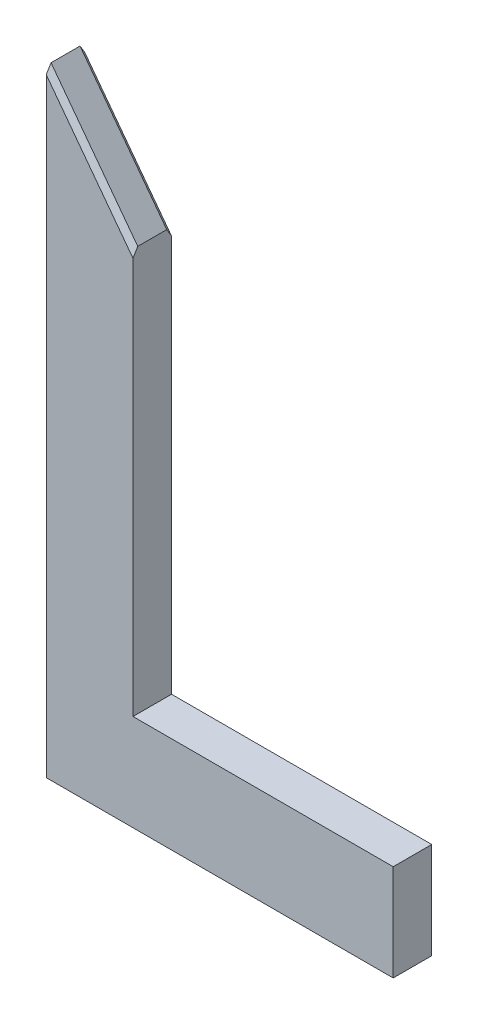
ISO-10303-21;
HEADER;
FILE_DESCRIPTION(('STEP AP214'),'2;1');
FILE_NAME('part.step','',(''),(''),'','','');
FILE_SCHEMA(('AUTOMOTIVE_DESIGN { 1 0 10303 214 1 1 1 1 }'));
ENDSEC;
DATA;
#1=APPLICATION_CONTEXT('core data for automotive mechanical design processes');
#2=APPLICATION_PROTOCOL_DEFINITION('international standard','automotive_design',2000,#1);
#3=PRODUCT_CONTEXT('',#1,'mechanical');
#4=PRODUCT('Part','Part','',(#3));
#5=PRODUCT_RELATED_PRODUCT_CATEGORY('part','',(#4));
#6=PRODUCT_DEFINITION_FORMATION('','',#4);
#7=PRODUCT_DEFINITION_CONTEXT('part definition',#1,'design');
#8=PRODUCT_DEFINITION('design','',#6,#7);
#9=PRODUCT_DEFINITION_SHAPE('','',#8);
#10=(LENGTH_UNIT() NAMED_UNIT(*) SI_UNIT(.MILLI.,.METRE.));
#11=(NAMED_UNIT(*) PLANE_ANGLE_UNIT() SI_UNIT($,.RADIAN.));
#12=(NAMED_UNIT(*) SI_UNIT($,.STERADIAN.) SOLID_ANGLE_UNIT());
#13=UNCERTAINTY_MEASURE_WITH_UNIT(LENGTH_MEASURE(1.E-05),#10,'distance_accuracy_value','');
#14=(GEOMETRIC_REPRESENTATION_CONTEXT(3) GLOBAL_UNCERTAINTY_ASSIGNED_CONTEXT((#13)) GLOBAL_UNIT_ASSIGNED_CONTEXT((#10,
#11,#12)) REPRESENTATION_CONTEXT('',''));
#15=CARTESIAN_POINT('',(0.,0.,0.));
#16=DIRECTION('',(0.,0.,1.));
#17=DIRECTION('',(1.,0.,0.));
#18=AXIS2_PLACEMENT_3D('',#15,#16,#17);
#19=CARTESIAN_POINT('',(0.,0.,-12.7));
#20=DIRECTION('',(-1.,0.,0.));
#21=DIRECTION('',(0.,0.,1.));
#22=AXIS2_PLACEMENT_3D('',#19,#20,#21);
#23=PLANE('',#22);
#24=DIRECTION('',(0.,-1.,0.));
#25=VECTOR('',#24,1.);
#26=CARTESIAN_POINT('',(0.,0.,0.));
#27=LINE('',#26,#25);
#28=CARTESIAN_POINT('',(0.,200.575333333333,0.));
#29=VERTEX_POINT('',#28);
#30=CARTESIAN_POINT('',(0.,0.,0.));
#31=VERTEX_POINT('',#30);
#32=EDGE_CURVE('E131',#29,#31,#27,.T.);
#33=ORIENTED_EDGE('',*,*,#32,.F.);
#34=DIRECTION('',(0.,0.857492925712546,-0.514495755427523));
#35=VECTOR('',#34,1.);
#36=CARTESIAN_POINT('',(0.,58.6964117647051,85.1273529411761));
#37=LINE('',#36,#35);
#38=CARTESIAN_POINT('',(0.,203.2,-1.57480000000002));
#39=VERTEX_POINT('',#38);
#40=EDGE_CURVE('E150',#29,#39,#37,.T.);
#41=ORIENTED_EDGE('',*,*,#40,.T.);
#42=DIRECTION('',(0.,0.,1.));
#43=VECTOR('',#42,1.);
#44=CARTESIAN_POINT('',(0.,203.2,-12.7));
#45=LINE('',#44,#43);
#46=CARTESIAN_POINT('',(0.,203.2,-11.1252));
#47=VERTEX_POINT('',#46);
#48=EDGE_CURVE('E141',#47,#39,#45,.T.);
#49=ORIENTED_EDGE('',*,*,#48,.F.);
#50=DIRECTION('',(0.,0.857492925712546,0.514495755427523));
#51=VECTOR('',#50,1.);
#52=CARTESIAN_POINT('',(0.,53.0934705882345,-101.189117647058));
#53=LINE('',#52,#51);
#54=CARTESIAN_POINT('',(0.,200.575333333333,-12.7));
#55=VERTEX_POINT('',#54);
#56=EDGE_CURVE('E148',#47,#55,#53,.F.);
#57=ORIENTED_EDGE('',*,*,#56,.T.);
#58=DIRECTION('',(0.,-1.,0.));
#59=VECTOR('',#58,1.);
#60=CARTESIAN_POINT('',(0.,0.,-12.7));
#61=LINE('',#60,#59);
#62=CARTESIAN_POINT('',(0.,0.,-12.7));
#63=VERTEX_POINT('',#62);
#64=EDGE_CURVE('E132',#55,#63,#61,.T.);
#65=ORIENTED_EDGE('',*,*,#64,.T.);
#66=DIRECTION('',(0.,0.,1.));
#67=VECTOR('',#66,1.);
#68=CARTESIAN_POINT('',(0.,0.,-12.7));
#69=LINE('',#68,#67);
#70=EDGE_CURVE('E137',#63,#31,#69,.T.);
#71=ORIENTED_EDGE('',*,*,#70,.T.);
#72=EDGE_LOOP('',(#33,#41,#49,#57,#65,#71));
#73=FACE_BOUND('',#72,.T.);
#74=ADVANCED_FACE('F34',(#73),#23,.T.);
#75=CARTESIAN_POINT('',(0.,203.2,-12.7));
#76=DIRECTION('',(0.8,0.6,0.));
#77=DIRECTION('',(-0.6,0.8,0.));
#78=AXIS2_PLACEMENT_3D('',#75,#76,#77);
#79=PLANE('',#78);
#80=DIRECTION('',(0.,0.,1.));
#81=VECTOR('',#80,1.);
#82=CARTESIAN_POINT('',(28.575,165.1,-12.7));
#83=LINE('',#82,#81);
#84=CARTESIAN_POINT('',(28.575,165.1,-11.1252));
#85=VERTEX_POINT('',#84);
#86=CARTESIAN_POINT('',(28.575,165.1,-1.57480000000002));
#87=VERTEX_POINT('',#86);
#88=EDGE_CURVE('E110',#85,#87,#83,.T.);
#89=ORIENTED_EDGE('',*,*,#88,.F.);
#90=DIRECTION('',(-0.6,0.8,0.));
#91=VECTOR('',#90,1.);
#92=CARTESIAN_POINT('',(0.,203.2,-11.1252));
#93=LINE('',#92,#91);
#94=EDGE_CURVE('E152',#85,#47,#93,.T.);
#95=ORIENTED_EDGE('',*,*,#94,.T.);
#96=ORIENTED_EDGE('',*,*,#48,.T.);
#97=DIRECTION('',(0.6,-0.8,0.));
#98=VECTOR('',#97,1.);
#99=CARTESIAN_POINT('',(152.4,0.,-1.57480000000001));
#100=LINE('',#99,#98);
#101=EDGE_CURVE('E154',#39,#87,#100,.T.);
#102=ORIENTED_EDGE('',*,*,#101,.T.);
#103=EDGE_LOOP('',(#89,#95,#96,#102));
#104=FACE_BOUND('',#103,.T.);
#105=ADVANCED_FACE('F175',(#104),#79,.T.);
#106=CARTESIAN_POINT('',(0.,0.,-12.7));
#107=DIRECTION('',(0.,-1.,0.));
#108=DIRECTION('',(0.,0.,-1.));
#109=AXIS2_PLACEMENT_3D('',#106,#107,#108);
#110=PLANE('',#109);
#111=DIRECTION('',(0.,0.,-1.));
#112=VECTOR('',#111,1.);
#113=CARTESIAN_POINT('',(114.3,0.,317.8966272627));
#114=LINE('',#113,#112);
#115=CARTESIAN_POINT('',(114.3,0.,0.));
#116=VERTEX_POINT('',#115);
#117=CARTESIAN_POINT('',(114.3,0.,-12.7));
#118=VERTEX_POINT('',#117);
#119=EDGE_CURVE('E124',#116,#118,#114,.T.);
#120=ORIENTED_EDGE('',*,*,#119,.F.);
#121=DIRECTION('',(1.,0.,0.));
#122=VECTOR('',#121,1.);
#123=CARTESIAN_POINT('',(0.,0.,0.));
#124=LINE('',#123,#122);
#125=EDGE_CURVE('E135',#31,#116,#124,.T.);
#126=ORIENTED_EDGE('',*,*,#125,.F.);
#127=ORIENTED_EDGE('',*,*,#70,.F.);
#128=DIRECTION('',(1.,0.,0.));
#129=VECTOR('',#128,1.);
#130=CARTESIAN_POINT('',(0.,0.,-12.7));
#131=LINE('',#130,#129);
#132=EDGE_CURVE('E134',#63,#118,#131,.T.);
#133=ORIENTED_EDGE('',*,*,#132,.T.);
#134=EDGE_LOOP('',(#120,#126,#127,#133));
#135=FACE_BOUND('',#134,.T.);
#136=ADVANCED_FACE('F166',(#135),#110,.T.);
#137=CARTESIAN_POINT('',(0.,0.,-12.7));
#138=DIRECTION('',(0.,0.,-1.));
#139=DIRECTION('',(-1.,0.,0.));
#140=AXIS2_PLACEMENT_3D('',#137,#138,#139);
#141=PLANE('',#140);
#142=DIRECTION('',(1.,0.,0.));
#143=VECTOR('',#142,1.);
#144=CARTESIAN_POINT('',(142.875,31.75,-12.7));
#145=LINE('',#144,#143);
#146=CARTESIAN_POINT('',(28.575,31.75,-12.7));
#147=VERTEX_POINT('',#146);
#148=CARTESIAN_POINT('',(114.3,31.75,-12.7));
#149=VERTEX_POINT('',#148);
#150=EDGE_CURVE('E98',#147,#149,#145,.T.);
#151=ORIENTED_EDGE('',*,*,#150,.T.);
#152=DIRECTION('',(0.,1.,0.));
#153=VECTOR('',#152,1.);
#154=CARTESIAN_POINT('',(114.3,0.,-12.7));
#155=LINE('',#154,#153);
#156=EDGE_CURVE('E57',#118,#149,#155,.T.);
#157=ORIENTED_EDGE('',*,*,#156,.F.);
#158=ORIENTED_EDGE('',*,*,#132,.F.);
#159=ORIENTED_EDGE('',*,*,#64,.F.);
#160=DIRECTION('',(0.6,-0.8,0.));
#161=VECTOR('',#160,1.);
#162=CARTESIAN_POINT('',(96.2761599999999,72.20712,-12.7));
#163=LINE('',#162,#161);
#164=CARTESIAN_POINT('',(28.575,162.475333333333,-12.7));
#165=VERTEX_POINT('',#164);
#166=EDGE_CURVE('E116',#55,#165,#163,.T.);
#167=ORIENTED_EDGE('',*,*,#166,.T.);
#168=DIRECTION('',(0.,-1.,0.));
#169=VECTOR('',#168,1.);
#170=CARTESIAN_POINT('',(28.575,184.15,-12.7));
#171=LINE('',#170,#169);
#172=EDGE_CURVE('E103',#165,#147,#171,.T.);
#173=ORIENTED_EDGE('',*,*,#172,.T.);
#174=EDGE_LOOP('',(#151,#157,#158,#159,#167,#173));
#175=FACE_BOUND('',#174,.T.);
#176=ADVANCED_FACE('F113',(#175),#141,.T.);
#177=CARTESIAN_POINT('',(0.,0.,0.));
#178=DIRECTION('',(0.,0.,-1.));
#179=DIRECTION('',(-1.,0.,0.));
#180=AXIS2_PLACEMENT_3D('',#177,#178,#179);
#181=PLANE('',#180);
#182=DIRECTION('',(0.,1.,0.));
#183=VECTOR('',#182,1.);
#184=CARTESIAN_POINT('',(114.3,0.,0.));
#185=LINE('',#184,#183);
#186=CARTESIAN_POINT('',(114.3,31.75,0.));
#187=VERTEX_POINT('',#186);
#188=EDGE_CURVE('E128',#116,#187,#185,.T.);
#189=ORIENTED_EDGE('',*,*,#188,.T.);
#190=DIRECTION('',(1.,0.,0.));
#191=VECTOR('',#190,1.);
#192=CARTESIAN_POINT('',(114.3,31.75,0.));
#193=LINE('',#192,#191);
#194=CARTESIAN_POINT('',(28.575,31.75,0.));
#195=VERTEX_POINT('',#194);
#196=EDGE_CURVE('E49',#195,#187,#193,.T.);
#197=ORIENTED_EDGE('',*,*,#196,.F.);
#198=DIRECTION('',(0.,-1.,0.));
#199=VECTOR('',#198,1.);
#200=CARTESIAN_POINT('',(28.575,184.15,0.));
#201=LINE('',#200,#199);
#202=CARTESIAN_POINT('',(28.575,162.475333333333,0.));
#203=VERTEX_POINT('',#202);
#204=EDGE_CURVE('E109',#203,#195,#201,.T.);
#205=ORIENTED_EDGE('',*,*,#204,.F.);
#206=DIRECTION('',(-0.6,0.8,0.));
#207=VECTOR('',#206,1.);
#208=CARTESIAN_POINT('',(-1.25984000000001,202.25512,0.));
#209=LINE('',#208,#207);
#210=EDGE_CURVE('E144',#203,#29,#209,.T.);
#211=ORIENTED_EDGE('',*,*,#210,.T.);
#212=ORIENTED_EDGE('',*,*,#32,.T.);
#213=ORIENTED_EDGE('',*,*,#125,.T.);
#214=EDGE_LOOP('',(#189,#197,#205,#211,#212,#213));
#215=FACE_BOUND('',#214,.T.);
#216=ADVANCED_FACE('F161',(#215),#181,.F.);
#217=CARTESIAN_POINT('',(96.27616,72.20712,0.));
#218=DIRECTION('',(0.565685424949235,0.424264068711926,0.707106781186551));
#219=DIRECTION('',(0.780868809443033,0.,-0.624695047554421));
#220=AXIS2_PLACEMENT_3D('',#217,#218,#219);
#221=PLANE('',#220);
#222=DIRECTION('',(0.,-0.857492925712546,0.514495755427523));
#223=VECTOR('',#222,1.);
#224=CARTESIAN_POINT('',(28.575,96.1016470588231,39.8242117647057));
#225=LINE('',#224,#223);
#226=EDGE_CURVE('E122',#87,#203,#225,.T.);
#227=ORIENTED_EDGE('',*,*,#226,.F.);
#228=ORIENTED_EDGE('',*,*,#101,.F.);
#229=ORIENTED_EDGE('',*,*,#40,.F.);
#230=ORIENTED_EDGE('',*,*,#210,.F.);
#231=EDGE_LOOP('',(#227,#228,#229,#230));
#232=FACE_BOUND('',#231,.T.);
#233=ADVANCED_FACE('F179',(#232),#221,.T.);
#234=CARTESIAN_POINT('',(0.,203.2,-11.1252));
#235=DIRECTION('',(-0.565685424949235,-0.424264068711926,0.707106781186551));
#236=DIRECTION('',(0.780868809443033,0.,0.624695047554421));
#237=AXIS2_PLACEMENT_3D('',#234,#235,#236);
#238=PLANE('',#237);
#239=DIRECTION('',(0.,-0.857492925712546,-0.514495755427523));
#240=VECTOR('',#239,1.);
#241=CARTESIAN_POINT('',(28.575,193.114705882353,5.68362352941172));
#242=LINE('',#241,#240);
#243=EDGE_CURVE('E11',#165,#85,#242,.F.);
#244=ORIENTED_EDGE('',*,*,#243,.F.);
#245=ORIENTED_EDGE('',*,*,#166,.F.);
#246=ORIENTED_EDGE('',*,*,#56,.F.);
#247=ORIENTED_EDGE('',*,*,#94,.F.);
#248=EDGE_LOOP('',(#244,#245,#246,#247));
#249=FACE_BOUND('',#248,.T.);
#250=ADVANCED_FACE('F36',(#249),#238,.F.);
#251=CARTESIAN_POINT('',(114.3,0.,317.8966272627));
#252=DIRECTION('',(-1.,0.,0.));
#253=DIRECTION('',(0.,-1.,0.));
#254=AXIS2_PLACEMENT_3D('',#251,#252,#253);
#255=PLANE('',#254);
#256=ORIENTED_EDGE('',*,*,#156,.T.);
#257=DIRECTION('',(0.,0.,1.));
#258=VECTOR('',#257,1.);
#259=CARTESIAN_POINT('',(114.3,31.75,317.8966272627));
#260=LINE('',#259,#258);
#261=EDGE_CURVE('E42',#149,#187,#260,.T.);
#262=ORIENTED_EDGE('',*,*,#261,.T.);
#263=ORIENTED_EDGE('',*,*,#188,.F.);
#264=ORIENTED_EDGE('',*,*,#119,.T.);
#265=EDGE_LOOP('',(#256,#262,#263,#264));
#266=FACE_BOUND('',#265,.T.);
#267=ADVANCED_FACE('F159',(#266),#255,.F.);
#268=CARTESIAN_POINT('',(114.3,31.75,-12.7));
#269=DIRECTION('',(0.,-1.,0.));
#270=DIRECTION('',(1.,0.,0.));
#271=AXIS2_PLACEMENT_3D('',#268,#269,#270);
#272=PLANE('',#271);
#273=ORIENTED_EDGE('',*,*,#150,.F.);
#274=DIRECTION('',(0.,0.,1.));
#275=VECTOR('',#274,1.);
#276=CARTESIAN_POINT('',(28.575,31.75,-12.7));
#277=LINE('',#276,#275);
#278=EDGE_CURVE('E101',#147,#195,#277,.T.);
#279=ORIENTED_EDGE('',*,*,#278,.T.);
#280=ORIENTED_EDGE('',*,*,#196,.T.);
#281=ORIENTED_EDGE('',*,*,#261,.F.);
#282=EDGE_LOOP('',(#273,#279,#280,#281));
#283=FACE_BOUND('',#282,.T.);
#284=ADVANCED_FACE('F100',(#283),#272,.F.);
#285=CARTESIAN_POINT('',(28.575,184.15,-12.7));
#286=DIRECTION('',(-1.,0.,0.));
#287=DIRECTION('',(0.,-1.,0.));
#288=AXIS2_PLACEMENT_3D('',#285,#286,#287);
#289=PLANE('',#288);
#290=ORIENTED_EDGE('',*,*,#226,.T.);
#291=ORIENTED_EDGE('',*,*,#204,.T.);
#292=ORIENTED_EDGE('',*,*,#278,.F.);
#293=ORIENTED_EDGE('',*,*,#172,.F.);
#294=ORIENTED_EDGE('',*,*,#243,.T.);
#295=ORIENTED_EDGE('',*,*,#88,.T.);
#296=EDGE_LOOP('',(#290,#291,#292,#293,#294,#295));
#297=FACE_BOUND('',#296,.T.);
#298=ADVANCED_FACE('F106',(#297),#289,.F.);
#299=CLOSED_SHELL('',(#74,#105,#136,#176,#216,#233,#250,#267,#284,#298));
#300=MANIFOLD_SOLID_BREP('B2',#299);
#301=ADVANCED_BREP_SHAPE_REPRESENTATION('',(#18,#300),#14);
#302=SHAPE_DEFINITION_REPRESENTATION(#9,#301);
ENDSEC;
END-ISO-10303-21;
